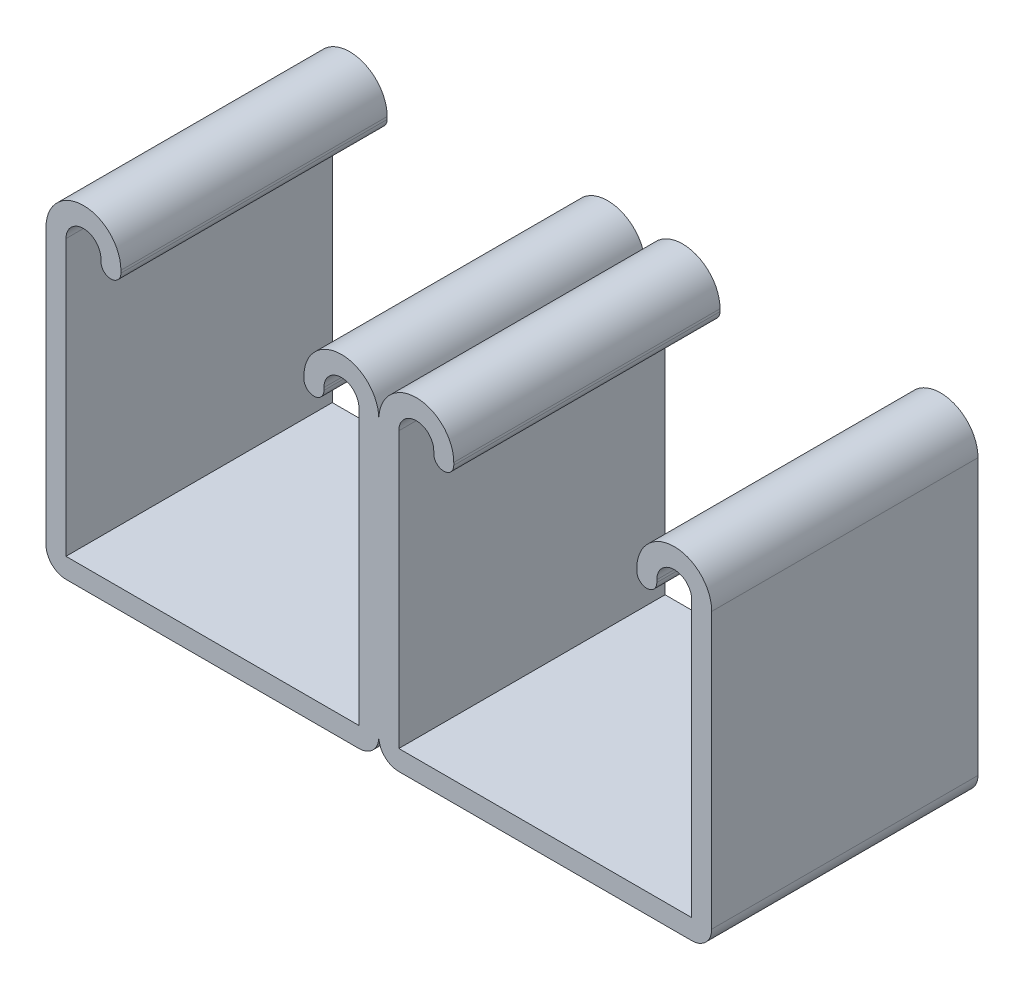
from build123d import *

# Parameters (mm, degrees)
BASE_EXTRUDE_DEPTH = 12.7
LPATTERN1_COUNT    = 2
LPATTERN1_PITCH    = 31.75


with BuildPart() as part:
    # Sketch1 → Base-Extrude (new, symmetric)
    with BuildSketch(Plane.XY):
        with BuildLine():
            Line((-31.75, 14.335125), (-31.75, -11.9126))
            ThreePointArc((-31.75, -11.9126), (-31.192038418, -13.259638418), (-29.845, -13.8176))
            Line((-29.845, -13.8176), (-1.905, -13.8176))
            ThreePointArc((-1.905, -13.8176), (-0.557961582, -13.259638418), (0, -11.9126))
            Line((0, -11.9126), (0, 14.335125))
            ThreePointArc((0, 14.335125), (-3.571875, 17.907), (-7.14375, 14.335125))
            Line((-7.14375, 14.335125), (-7.14375, 14.097))
            ThreePointArc((-7.14375, 14.097), (-6.19125, 13.1445), (-5.23875, 14.097))
            Line((-5.23875, 14.097), (-5.23875, 14.335125))
            ThreePointArc((-5.23875, 14.335125), (-3.571875, 16.002), (-1.905, 14.335125))
            Line((-1.905, 14.335125), (-1.905, -11.9126))
            Line((-1.905, -11.9126), (-29.845, -11.9126))
            Line((-29.845, -11.9126), (-29.845, 14.335125))
            ThreePointArc((-29.845, 14.335125), (-28.178125, 16.002), (-26.51125, 14.335125))
            Line((-26.51125, 14.335125), (-26.51125, 14.097))
            ThreePointArc((-26.51125, 14.097), (-25.55875, 13.1445), (-24.60625, 14.097))
            Line((-24.60625, 14.097), (-24.60625, 14.335125))
            ThreePointArc((-24.60625, 14.335125), (-28.178125, 17.907), (-31.75, 14.335125))
        make_face()
    base_extrude = extrude(amount=BASE_EXTRUDE_DEPTH, both=True)

    # LPattern1: Base-Extrude ×2
    with Locations(*[(i * LPATTERN1_PITCH, 0, 0) for i in range(1, LPATTERN1_COUNT)]):
        add(base_extrude)


solid = part.part
